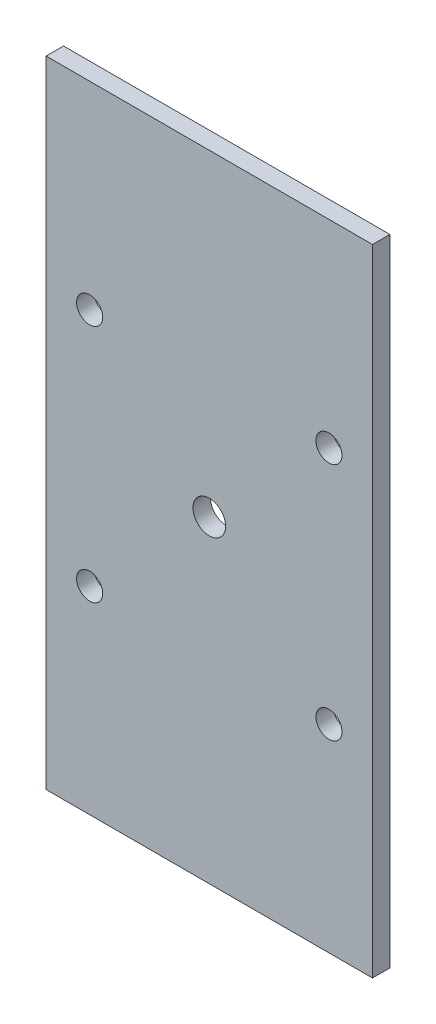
ISO-10303-21;
HEADER;
FILE_DESCRIPTION(('STEP AP214'),'2;1');
FILE_NAME('part.step','',(''),(''),'','','');
FILE_SCHEMA(('AUTOMOTIVE_DESIGN { 1 0 10303 214 1 1 1 1 }'));
ENDSEC;
DATA;
#1=APPLICATION_CONTEXT('core data for automotive mechanical design processes');
#2=APPLICATION_PROTOCOL_DEFINITION('international standard','automotive_design',2000,#1);
#3=PRODUCT_CONTEXT('',#1,'mechanical');
#4=PRODUCT('Part','Part','',(#3));
#5=PRODUCT_RELATED_PRODUCT_CATEGORY('part','',(#4));
#6=PRODUCT_DEFINITION_FORMATION('','',#4);
#7=PRODUCT_DEFINITION_CONTEXT('part definition',#1,'design');
#8=PRODUCT_DEFINITION('design','',#6,#7);
#9=PRODUCT_DEFINITION_SHAPE('','',#8);
#10=(LENGTH_UNIT() NAMED_UNIT(*) SI_UNIT(.MILLI.,.METRE.));
#11=(NAMED_UNIT(*) PLANE_ANGLE_UNIT() SI_UNIT($,.RADIAN.));
#12=(NAMED_UNIT(*) SI_UNIT($,.STERADIAN.) SOLID_ANGLE_UNIT());
#13=UNCERTAINTY_MEASURE_WITH_UNIT(LENGTH_MEASURE(1.E-05),#10,'distance_accuracy_value','');
#14=(GEOMETRIC_REPRESENTATION_CONTEXT(3) GLOBAL_UNCERTAINTY_ASSIGNED_CONTEXT((#13)) GLOBAL_UNIT_ASSIGNED_CONTEXT((#10,
#11,#12)) REPRESENTATION_CONTEXT('',''));
#15=CARTESIAN_POINT('',(0.,0.,0.));
#16=DIRECTION('',(0.,0.,1.));
#17=DIRECTION('',(1.,0.,0.));
#18=AXIS2_PLACEMENT_3D('',#15,#16,#17);
#19=CARTESIAN_POINT('',(75.,146.,8.));
#20=DIRECTION('',(0.,-1.,0.));
#21=DIRECTION('',(0.,0.,-1.));
#22=AXIS2_PLACEMENT_3D('',#19,#20,#21);
#23=PLANE('',#22);
#24=DIRECTION('',(-1.,0.,0.));
#25=VECTOR('',#24,1.);
#26=CARTESIAN_POINT('',(75.,146.,0.));
#27=LINE('',#26,#25);
#28=CARTESIAN_POINT('',(75.,146.,0.));
#29=VERTEX_POINT('',#28);
#30=CARTESIAN_POINT('',(-75.,146.,0.));
#31=VERTEX_POINT('',#30);
#32=EDGE_CURVE('E105',#29,#31,#27,.T.);
#33=ORIENTED_EDGE('',*,*,#32,.T.);
#34=DIRECTION('',(0.,0.,-1.));
#35=VECTOR('',#34,1.);
#36=CARTESIAN_POINT('',(-75.,146.,8.));
#37=LINE('',#36,#35);
#38=CARTESIAN_POINT('',(-75.,146.,8.));
#39=VERTEX_POINT('',#38);
#40=EDGE_CURVE('E11',#39,#31,#37,.T.);
#41=ORIENTED_EDGE('',*,*,#40,.F.);
#42=DIRECTION('',(-1.,0.,0.));
#43=VECTOR('',#42,1.);
#44=CARTESIAN_POINT('',(75.,146.,8.));
#45=LINE('',#44,#43);
#46=CARTESIAN_POINT('',(75.,146.,8.));
#47=VERTEX_POINT('',#46);
#48=EDGE_CURVE('E88',#47,#39,#45,.T.);
#49=ORIENTED_EDGE('',*,*,#48,.F.);
#50=DIRECTION('',(0.,0.,-1.));
#51=VECTOR('',#50,1.);
#52=CARTESIAN_POINT('',(75.,146.,8.));
#53=LINE('',#52,#51);
#54=EDGE_CURVE('E96',#47,#29,#53,.T.);
#55=ORIENTED_EDGE('',*,*,#54,.T.);
#56=EDGE_LOOP('',(#33,#41,#49,#55));
#57=FACE_BOUND('',#56,.T.);
#58=ADVANCED_FACE('F39',(#57),#23,.F.);
#59=CARTESIAN_POINT('',(-75.,-146.,8.));
#60=DIRECTION('',(1.,0.,0.));
#61=DIRECTION('',(0.,0.,-1.));
#62=AXIS2_PLACEMENT_3D('',#59,#60,#61);
#63=PLANE('',#62);
#64=DIRECTION('',(0.,-1.,0.));
#65=VECTOR('',#64,1.);
#66=CARTESIAN_POINT('',(-75.,-146.,0.));
#67=LINE('',#66,#65);
#68=CARTESIAN_POINT('',(-75.,-146.,0.));
#69=VERTEX_POINT('',#68);
#70=EDGE_CURVE('E94',#31,#69,#67,.T.);
#71=ORIENTED_EDGE('',*,*,#70,.T.);
#72=DIRECTION('',(0.,0.,-1.));
#73=VECTOR('',#72,1.);
#74=CARTESIAN_POINT('',(-75.,-146.,8.));
#75=LINE('',#74,#73);
#76=CARTESIAN_POINT('',(-75.,-146.,8.));
#77=VERTEX_POINT('',#76);
#78=EDGE_CURVE('E50',#77,#69,#75,.T.);
#79=ORIENTED_EDGE('',*,*,#78,.F.);
#80=DIRECTION('',(0.,-1.,0.));
#81=VECTOR('',#80,1.);
#82=CARTESIAN_POINT('',(-75.,-146.,8.));
#83=LINE('',#82,#81);
#84=EDGE_CURVE('E83',#39,#77,#83,.T.);
#85=ORIENTED_EDGE('',*,*,#84,.F.);
#86=ORIENTED_EDGE('',*,*,#40,.T.);
#87=EDGE_LOOP('',(#71,#79,#85,#86));
#88=FACE_BOUND('',#87,.T.);
#89=ADVANCED_FACE('F93',(#88),#63,.F.);
#90=CARTESIAN_POINT('',(75.,-146.,8.));
#91=DIRECTION('',(0.,1.,0.));
#92=DIRECTION('',(0.,0.,1.));
#93=AXIS2_PLACEMENT_3D('',#90,#91,#92);
#94=PLANE('',#93);
#95=DIRECTION('',(1.,0.,0.));
#96=VECTOR('',#95,1.);
#97=CARTESIAN_POINT('',(75.,-146.,0.));
#98=LINE('',#97,#96);
#99=CARTESIAN_POINT('',(75.,-146.,0.));
#100=VERTEX_POINT('',#99);
#101=EDGE_CURVE('E75',#69,#100,#98,.T.);
#102=ORIENTED_EDGE('',*,*,#101,.T.);
#103=DIRECTION('',(0.,0.,-1.));
#104=VECTOR('',#103,1.);
#105=CARTESIAN_POINT('',(75.,-146.,8.));
#106=LINE('',#105,#104);
#107=CARTESIAN_POINT('',(75.,-146.,8.));
#108=VERTEX_POINT('',#107);
#109=EDGE_CURVE('E91',#108,#100,#106,.T.);
#110=ORIENTED_EDGE('',*,*,#109,.F.);
#111=DIRECTION('',(1.,0.,0.));
#112=VECTOR('',#111,1.);
#113=CARTESIAN_POINT('',(75.,-146.,8.));
#114=LINE('',#113,#112);
#115=EDGE_CURVE('E89',#77,#108,#114,.T.);
#116=ORIENTED_EDGE('',*,*,#115,.F.);
#117=ORIENTED_EDGE('',*,*,#78,.T.);
#118=EDGE_LOOP('',(#102,#110,#116,#117));
#119=FACE_BOUND('',#118,.T.);
#120=ADVANCED_FACE('F98',(#119),#94,.F.);
#121=CARTESIAN_POINT('',(75.,-146.,8.));
#122=DIRECTION('',(-1.,0.,0.));
#123=DIRECTION('',(0.,0.,1.));
#124=AXIS2_PLACEMENT_3D('',#121,#122,#123);
#125=PLANE('',#124);
#126=DIRECTION('',(0.,1.,0.));
#127=VECTOR('',#126,1.);
#128=CARTESIAN_POINT('',(75.,-146.,0.));
#129=LINE('',#128,#127);
#130=EDGE_CURVE('E76',#100,#29,#129,.T.);
#131=ORIENTED_EDGE('',*,*,#130,.T.);
#132=ORIENTED_EDGE('',*,*,#54,.F.);
#133=DIRECTION('',(0.,1.,0.));
#134=VECTOR('',#133,1.);
#135=CARTESIAN_POINT('',(75.,-146.,8.));
#136=LINE('',#135,#134);
#137=EDGE_CURVE('E54',#108,#47,#136,.T.);
#138=ORIENTED_EDGE('',*,*,#137,.F.);
#139=ORIENTED_EDGE('',*,*,#109,.T.);
#140=EDGE_LOOP('',(#131,#132,#138,#139));
#141=FACE_BOUND('',#140,.T.);
#142=ADVANCED_FACE('F109',(#141),#125,.F.);
#143=CARTESIAN_POINT('',(0.,0.,8.));
#144=DIRECTION('',(0.,0.,-1.));
#145=DIRECTION('',(-1.,0.,0.));
#146=AXIS2_PLACEMENT_3D('',#143,#144,#145);
#147=PLANE('',#146);
#148=CARTESIAN_POINT('',(0.,0.,8.));
#149=DIRECTION('',(0.,0.,1.));
#150=DIRECTION('',(1.,0.,0.));
#151=AXIS2_PLACEMENT_3D('',#148,#149,#150);
#152=CIRCLE('',#151,7.5);
#153=CARTESIAN_POINT('',(7.5,0.,8.));
#154=VERTEX_POINT('',#153);
#155=EDGE_CURVE('E140',#154,#154,#152,.T.);
#156=ORIENTED_EDGE('',*,*,#155,.F.);
#157=EDGE_LOOP('',(#156));
#158=FACE_BOUND('',#157,.T.);
#159=CARTESIAN_POINT('',(55.,55.,8.));
#160=DIRECTION('',(0.,0.,1.));
#161=DIRECTION('',(1.,0.,0.));
#162=AXIS2_PLACEMENT_3D('',#159,#160,#161);
#163=CIRCLE('',#162,6.);
#164=CARTESIAN_POINT('',(61.,55.,8.));
#165=VERTEX_POINT('',#164);
#166=EDGE_CURVE('E118',#165,#165,#163,.T.);
#167=ORIENTED_EDGE('',*,*,#166,.F.);
#168=EDGE_LOOP('',(#167));
#169=FACE_BOUND('',#168,.T.);
#170=CARTESIAN_POINT('',(-55.,-55.,8.));
#171=DIRECTION('',(0.,0.,1.));
#172=DIRECTION('',(1.,0.,0.));
#173=AXIS2_PLACEMENT_3D('',#170,#171,#172);
#174=CIRCLE('',#173,6.);
#175=CARTESIAN_POINT('',(-49.,-55.,8.));
#176=VERTEX_POINT('',#175);
#177=EDGE_CURVE('E123',#176,#176,#174,.T.);
#178=ORIENTED_EDGE('',*,*,#177,.F.);
#179=EDGE_LOOP('',(#178));
#180=FACE_BOUND('',#179,.T.);
#181=CARTESIAN_POINT('',(55.,-55.,8.));
#182=DIRECTION('',(0.,0.,1.));
#183=DIRECTION('',(1.,0.,0.));
#184=AXIS2_PLACEMENT_3D('',#181,#182,#183);
#185=CIRCLE('',#184,6.);
#186=CARTESIAN_POINT('',(61.,-55.,8.));
#187=VERTEX_POINT('',#186);
#188=EDGE_CURVE('E127',#187,#187,#185,.T.);
#189=ORIENTED_EDGE('',*,*,#188,.F.);
#190=EDGE_LOOP('',(#189));
#191=FACE_BOUND('',#190,.T.);
#192=CARTESIAN_POINT('',(-55.,55.,8.));
#193=DIRECTION('',(0.,0.,1.));
#194=DIRECTION('',(1.,0.,0.));
#195=AXIS2_PLACEMENT_3D('',#192,#193,#194);
#196=CIRCLE('',#195,6.);
#197=CARTESIAN_POINT('',(-49.,55.,8.));
#198=VERTEX_POINT('',#197);
#199=EDGE_CURVE('E116',#198,#198,#196,.T.);
#200=ORIENTED_EDGE('',*,*,#199,.F.);
#201=EDGE_LOOP('',(#200));
#202=FACE_BOUND('',#201,.T.);
#203=ORIENTED_EDGE('',*,*,#48,.T.);
#204=ORIENTED_EDGE('',*,*,#84,.T.);
#205=ORIENTED_EDGE('',*,*,#115,.T.);
#206=ORIENTED_EDGE('',*,*,#137,.T.);
#207=EDGE_LOOP('',(#203,#204,#205,#206));
#208=FACE_BOUND('',#207,.T.);
#209=ADVANCED_FACE('F87',(#158,#169,#180,#191,#202,#208),#147,.F.);
#210=CARTESIAN_POINT('',(0.,0.,0.));
#211=DIRECTION('',(0.,0.,-1.));
#212=DIRECTION('',(-1.,0.,0.));
#213=AXIS2_PLACEMENT_3D('',#210,#211,#212);
#214=PLANE('',#213);
#215=CARTESIAN_POINT('',(0.,0.,0.));
#216=DIRECTION('',(0.,0.,1.));
#217=DIRECTION('',(1.,0.,0.));
#218=AXIS2_PLACEMENT_3D('',#215,#216,#217);
#219=CIRCLE('',#218,7.5);
#220=CARTESIAN_POINT('',(7.5,0.,0.));
#221=VERTEX_POINT('',#220);
#222=EDGE_CURVE('E136',#221,#221,#219,.T.);
#223=ORIENTED_EDGE('',*,*,#222,.T.);
#224=EDGE_LOOP('',(#223));
#225=FACE_BOUND('',#224,.T.);
#226=CARTESIAN_POINT('',(55.,55.,0.));
#227=DIRECTION('',(0.,0.,1.));
#228=DIRECTION('',(1.,0.,0.));
#229=AXIS2_PLACEMENT_3D('',#226,#227,#228);
#230=CIRCLE('',#229,6.);
#231=CARTESIAN_POINT('',(61.,55.,0.));
#232=VERTEX_POINT('',#231);
#233=EDGE_CURVE('E126',#232,#232,#230,.T.);
#234=ORIENTED_EDGE('',*,*,#233,.T.);
#235=EDGE_LOOP('',(#234));
#236=FACE_BOUND('',#235,.T.);
#237=CARTESIAN_POINT('',(-55.,-55.,0.));
#238=DIRECTION('',(0.,0.,1.));
#239=DIRECTION('',(1.,0.,0.));
#240=AXIS2_PLACEMENT_3D('',#237,#238,#239);
#241=CIRCLE('',#240,6.);
#242=CARTESIAN_POINT('',(-49.,-55.,0.));
#243=VERTEX_POINT('',#242);
#244=EDGE_CURVE('E125',#243,#243,#241,.T.);
#245=ORIENTED_EDGE('',*,*,#244,.T.);
#246=EDGE_LOOP('',(#245));
#247=FACE_BOUND('',#246,.T.);
#248=CARTESIAN_POINT('',(55.,-55.,0.));
#249=DIRECTION('',(0.,0.,1.));
#250=DIRECTION('',(1.,0.,0.));
#251=AXIS2_PLACEMENT_3D('',#248,#249,#250);
#252=CIRCLE('',#251,6.);
#253=CARTESIAN_POINT('',(61.,-55.,0.));
#254=VERTEX_POINT('',#253);
#255=EDGE_CURVE('E131',#254,#254,#252,.T.);
#256=ORIENTED_EDGE('',*,*,#255,.T.);
#257=EDGE_LOOP('',(#256));
#258=FACE_BOUND('',#257,.T.);
#259=CARTESIAN_POINT('',(-55.,55.,0.));
#260=DIRECTION('',(0.,0.,1.));
#261=DIRECTION('',(1.,0.,0.));
#262=AXIS2_PLACEMENT_3D('',#259,#260,#261);
#263=CIRCLE('',#262,6.);
#264=CARTESIAN_POINT('',(-49.,55.,0.));
#265=VERTEX_POINT('',#264);
#266=EDGE_CURVE('E102',#265,#265,#263,.T.);
#267=ORIENTED_EDGE('',*,*,#266,.T.);
#268=EDGE_LOOP('',(#267));
#269=FACE_BOUND('',#268,.T.);
#270=ORIENTED_EDGE('',*,*,#32,.F.);
#271=ORIENTED_EDGE('',*,*,#130,.F.);
#272=ORIENTED_EDGE('',*,*,#101,.F.);
#273=ORIENTED_EDGE('',*,*,#70,.F.);
#274=EDGE_LOOP('',(#270,#271,#272,#273));
#275=FACE_BOUND('',#274,.T.);
#276=ADVANCED_FACE('F113',(#225,#236,#247,#258,#269,#275),#214,.T.);
#277=CARTESIAN_POINT('',(-55.,55.,0.));
#278=DIRECTION('',(0.,0.,1.));
#279=DIRECTION('',(1.,0.,0.));
#280=AXIS2_PLACEMENT_3D('',#277,#278,#279);
#281=CYLINDRICAL_SURFACE('',#280,6.);
#282=ORIENTED_EDGE('',*,*,#266,.F.);
#283=EDGE_LOOP('',(#282));
#284=FACE_BOUND('',#283,.T.);
#285=ORIENTED_EDGE('',*,*,#199,.T.);
#286=EDGE_LOOP('',(#285));
#287=FACE_BOUND('',#286,.T.);
#288=ADVANCED_FACE('F156',(#284,#287),#281,.F.);
#289=CARTESIAN_POINT('',(55.,-55.,0.));
#290=DIRECTION('',(0.,0.,1.));
#291=DIRECTION('',(1.,0.,0.));
#292=AXIS2_PLACEMENT_3D('',#289,#290,#291);
#293=CYLINDRICAL_SURFACE('',#292,6.);
#294=ORIENTED_EDGE('',*,*,#255,.F.);
#295=EDGE_LOOP('',(#294));
#296=FACE_BOUND('',#295,.T.);
#297=ORIENTED_EDGE('',*,*,#188,.T.);
#298=EDGE_LOOP('',(#297));
#299=FACE_BOUND('',#298,.T.);
#300=ADVANCED_FACE('F162',(#296,#299),#293,.F.);
#301=CARTESIAN_POINT('',(-55.,-55.,0.));
#302=DIRECTION('',(0.,0.,1.));
#303=DIRECTION('',(1.,0.,0.));
#304=AXIS2_PLACEMENT_3D('',#301,#302,#303);
#305=CYLINDRICAL_SURFACE('',#304,6.);
#306=ORIENTED_EDGE('',*,*,#244,.F.);
#307=EDGE_LOOP('',(#306));
#308=FACE_BOUND('',#307,.T.);
#309=ORIENTED_EDGE('',*,*,#177,.T.);
#310=EDGE_LOOP('',(#309));
#311=FACE_BOUND('',#310,.T.);
#312=ADVANCED_FACE('F169',(#308,#311),#305,.F.);
#313=CARTESIAN_POINT('',(55.,55.,0.));
#314=DIRECTION('',(0.,0.,1.));
#315=DIRECTION('',(1.,0.,0.));
#316=AXIS2_PLACEMENT_3D('',#313,#314,#315);
#317=CYLINDRICAL_SURFACE('',#316,6.);
#318=ORIENTED_EDGE('',*,*,#233,.F.);
#319=EDGE_LOOP('',(#318));
#320=FACE_BOUND('',#319,.T.);
#321=ORIENTED_EDGE('',*,*,#166,.T.);
#322=EDGE_LOOP('',(#321));
#323=FACE_BOUND('',#322,.T.);
#324=ADVANCED_FACE('F229',(#320,#323),#317,.F.);
#325=CARTESIAN_POINT('',(0.,0.,8.));
#326=DIRECTION('',(0.,0.,-1.));
#327=DIRECTION('',(-1.,0.,0.));
#328=AXIS2_PLACEMENT_3D('',#325,#326,#327);
#329=CYLINDRICAL_SURFACE('',#328,7.5);
#330=ORIENTED_EDGE('',*,*,#155,.T.);
#331=EDGE_LOOP('',(#330));
#332=FACE_BOUND('',#331,.T.);
#333=ORIENTED_EDGE('',*,*,#222,.F.);
#334=EDGE_LOOP('',(#333));
#335=FACE_BOUND('',#334,.T.);
#336=ADVANCED_FACE('F147',(#332,#335),#329,.F.);
#337=CLOSED_SHELL('',(#58,#89,#120,#142,#209,#276,#288,#300,#312,#324,#336));
#338=MANIFOLD_SOLID_BREP('B2',#337);
#339=ADVANCED_BREP_SHAPE_REPRESENTATION('',(#18,#338),#14);
#340=SHAPE_DEFINITION_REPRESENTATION(#9,#339);
ENDSEC;
END-ISO-10303-21;
